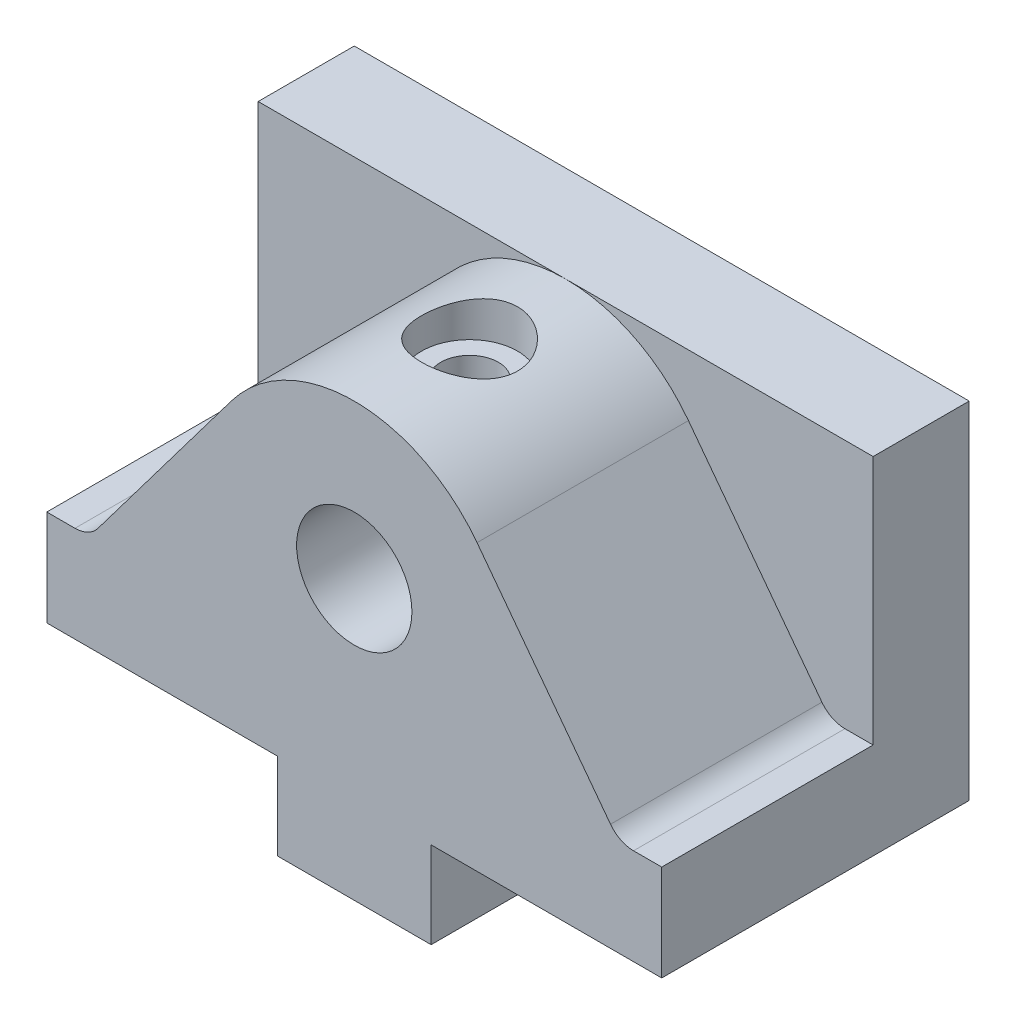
ISO-10303-21;
HEADER;
FILE_DESCRIPTION(('STEP AP214'),'2;1');
FILE_NAME('part.step','',(''),(''),'','','');
FILE_SCHEMA(('AUTOMOTIVE_DESIGN { 1 0 10303 214 1 1 1 1 }'));
ENDSEC;
DATA;
#1=APPLICATION_CONTEXT('core data for automotive mechanical design processes');
#2=APPLICATION_PROTOCOL_DEFINITION('international standard','automotive_design',2000,#1);
#3=PRODUCT_CONTEXT('',#1,'mechanical');
#4=PRODUCT('Part','Part','',(#3));
#5=PRODUCT_RELATED_PRODUCT_CATEGORY('part','',(#4));
#6=PRODUCT_DEFINITION_FORMATION('','',#4);
#7=PRODUCT_DEFINITION_CONTEXT('part definition',#1,'design');
#8=PRODUCT_DEFINITION('design','',#6,#7);
#9=PRODUCT_DEFINITION_SHAPE('','',#8);
#10=(LENGTH_UNIT() NAMED_UNIT(*) SI_UNIT(.MILLI.,.METRE.));
#11=(NAMED_UNIT(*) PLANE_ANGLE_UNIT() SI_UNIT($,.RADIAN.));
#12=(NAMED_UNIT(*) SI_UNIT($,.STERADIAN.) SOLID_ANGLE_UNIT());
#13=UNCERTAINTY_MEASURE_WITH_UNIT(LENGTH_MEASURE(1.E-05),#10,'distance_accuracy_value','');
#14=(GEOMETRIC_REPRESENTATION_CONTEXT(3) GLOBAL_UNCERTAINTY_ASSIGNED_CONTEXT((#13)) GLOBAL_UNIT_ASSIGNED_CONTEXT((#10,
#11,#12)) REPRESENTATION_CONTEXT('',''));
#15=CARTESIAN_POINT('',(0.,0.,0.));
#16=DIRECTION('',(0.,0.,1.));
#17=DIRECTION('',(1.,0.,0.));
#18=AXIS2_PLACEMENT_3D('',#15,#16,#17);
#19=CARTESIAN_POINT('',(-8.,0.,22.));
#20=DIRECTION('',(1.,0.,0.));
#21=DIRECTION('',(0.,1.,0.));
#22=AXIS2_PLACEMENT_3D('',#19,#20,#21);
#23=PLANE('',#22);
#24=DIRECTION('',(0.,0.,-1.));
#25=VECTOR('',#24,1.);
#26=CARTESIAN_POINT('',(-8.,0.,22.));
#27=LINE('',#26,#25);
#28=CARTESIAN_POINT('',(-8.,0.,22.));
#29=VERTEX_POINT('',#28);
#30=CARTESIAN_POINT('',(-8.,0.,-10.));
#31=VERTEX_POINT('',#30);
#32=EDGE_CURVE('E247',#29,#31,#27,.T.);
#33=ORIENTED_EDGE('',*,*,#32,.T.);
#34=DIRECTION('',(0.,1.,0.));
#35=VECTOR('',#34,1.);
#36=CARTESIAN_POINT('',(-8.,0.,-10.));
#37=LINE('',#36,#35);
#38=CARTESIAN_POINT('',(-8.00000000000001,-9.,-10.));
#39=VERTEX_POINT('',#38);
#40=EDGE_CURVE('E197',#39,#31,#37,.T.);
#41=ORIENTED_EDGE('',*,*,#40,.F.);
#42=DIRECTION('',(0.,0.,-1.));
#43=VECTOR('',#42,1.);
#44=CARTESIAN_POINT('',(-8.00000000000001,-9.,22.));
#45=LINE('',#44,#43);
#46=CARTESIAN_POINT('',(-8.00000000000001,-9.,22.));
#47=VERTEX_POINT('',#46);
#48=EDGE_CURVE('E270',#47,#39,#45,.T.);
#49=ORIENTED_EDGE('',*,*,#48,.F.);
#50=DIRECTION('',(0.,-1.,0.));
#51=VECTOR('',#50,1.);
#52=CARTESIAN_POINT('',(-8.,0.,22.));
#53=LINE('',#52,#51);
#54=EDGE_CURVE('E220',#29,#47,#53,.T.);
#55=ORIENTED_EDGE('',*,*,#54,.F.);
#56=EDGE_LOOP('',(#33,#41,#49,#55));
#57=FACE_BOUND('',#56,.T.);
#58=ADVANCED_FACE('F32',(#57),#23,.F.);
#59=CARTESIAN_POINT('',(-8.00000000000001,-9.,22.));
#60=DIRECTION('',(0.,1.,0.));
#61=DIRECTION('',(0.,0.,1.));
#62=AXIS2_PLACEMENT_3D('',#59,#60,#61);
#63=PLANE('',#62);
#64=CARTESIAN_POINT('',(0.,-9.,14.));
#65=DIRECTION('',(0.,-1.,0.));
#66=DIRECTION('',(0.,0.,-1.));
#67=AXIS2_PLACEMENT_3D('',#64,#65,#66);
#68=CIRCLE('',#67,2.99999999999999);
#69=CARTESIAN_POINT('',(0.,-9.,11.));
#70=VERTEX_POINT('',#69);
#71=EDGE_CURVE('E168',#70,#70,#68,.T.);
#72=ORIENTED_EDGE('',*,*,#71,.F.);
#73=EDGE_LOOP('',(#72));
#74=FACE_BOUND('',#73,.T.);
#75=CARTESIAN_POINT('',(0.,-9.,-2.));
#76=DIRECTION('',(0.,-1.,0.));
#77=DIRECTION('',(0.,0.,-1.));
#78=AXIS2_PLACEMENT_3D('',#75,#76,#77);
#79=CIRCLE('',#78,2.99999999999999);
#80=CARTESIAN_POINT('',(0.,-9.,-4.99999999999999));
#81=VERTEX_POINT('',#80);
#82=EDGE_CURVE('E167',#81,#81,#79,.T.);
#83=ORIENTED_EDGE('',*,*,#82,.F.);
#84=EDGE_LOOP('',(#83));
#85=FACE_BOUND('',#84,.T.);
#86=ORIENTED_EDGE('',*,*,#48,.T.);
#87=DIRECTION('',(-1.,0.,0.));
#88=VECTOR('',#87,1.);
#89=CARTESIAN_POINT('',(-8.00000000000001,-9.,-10.));
#90=LINE('',#89,#88);
#91=CARTESIAN_POINT('',(7.99999999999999,-9.,-10.));
#92=VERTEX_POINT('',#91);
#93=EDGE_CURVE('E194',#92,#39,#90,.T.);
#94=ORIENTED_EDGE('',*,*,#93,.F.);
#95=DIRECTION('',(0.,0.,-1.));
#96=VECTOR('',#95,1.);
#97=CARTESIAN_POINT('',(7.99999999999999,-9.,22.));
#98=LINE('',#97,#96);
#99=CARTESIAN_POINT('',(7.99999999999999,-9.,22.));
#100=VERTEX_POINT('',#99);
#101=EDGE_CURVE('E444',#100,#92,#98,.T.);
#102=ORIENTED_EDGE('',*,*,#101,.F.);
#103=DIRECTION('',(1.,0.,0.));
#104=VECTOR('',#103,1.);
#105=CARTESIAN_POINT('',(-8.00000000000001,-9.,22.));
#106=LINE('',#105,#104);
#107=EDGE_CURVE('E223',#47,#100,#106,.T.);
#108=ORIENTED_EDGE('',*,*,#107,.F.);
#109=EDGE_LOOP('',(#86,#94,#102,#108));
#110=FACE_BOUND('',#109,.T.);
#111=ADVANCED_FACE('F305',(#74,#85,#110),#63,.F.);
#112=CARTESIAN_POINT('',(7.99999999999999,-9.,22.));
#113=DIRECTION('',(-1.,0.,0.));
#114=DIRECTION('',(0.,-1.,0.));
#115=AXIS2_PLACEMENT_3D('',#112,#113,#114);
#116=PLANE('',#115);
#117=ORIENTED_EDGE('',*,*,#101,.T.);
#118=DIRECTION('',(0.,-1.,0.));
#119=VECTOR('',#118,1.);
#120=CARTESIAN_POINT('',(7.99999999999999,-9.,-10.));
#121=LINE('',#120,#119);
#122=CARTESIAN_POINT('',(8.,0.,-10.));
#123=VERTEX_POINT('',#122);
#124=EDGE_CURVE('E190',#123,#92,#121,.T.);
#125=ORIENTED_EDGE('',*,*,#124,.F.);
#126=DIRECTION('',(0.,0.,-1.));
#127=VECTOR('',#126,1.);
#128=CARTESIAN_POINT('',(8.,0.,22.));
#129=LINE('',#128,#127);
#130=CARTESIAN_POINT('',(8.,0.,22.));
#131=VERTEX_POINT('',#130);
#132=EDGE_CURVE('E424',#131,#123,#129,.T.);
#133=ORIENTED_EDGE('',*,*,#132,.F.);
#134=DIRECTION('',(0.,1.,0.));
#135=VECTOR('',#134,1.);
#136=CARTESIAN_POINT('',(7.99999999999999,-9.,22.));
#137=LINE('',#136,#135);
#138=EDGE_CURVE('E226',#100,#131,#137,.T.);
#139=ORIENTED_EDGE('',*,*,#138,.F.);
#140=EDGE_LOOP('',(#117,#125,#133,#139));
#141=FACE_BOUND('',#140,.T.);
#142=ADVANCED_FACE('F311',(#141),#116,.F.);
#143=CARTESIAN_POINT('',(8.,0.,22.));
#144=DIRECTION('',(0.,1.,0.));
#145=DIRECTION('',(0.,0.,1.));
#146=AXIS2_PLACEMENT_3D('',#143,#144,#145);
#147=PLANE('',#146);
#148=ORIENTED_EDGE('',*,*,#132,.T.);
#149=DIRECTION('',(-1.,0.,0.));
#150=VECTOR('',#149,1.);
#151=CARTESIAN_POINT('',(8.,0.,-10.));
#152=LINE('',#151,#150);
#153=CARTESIAN_POINT('',(32.,0.,-10.));
#154=VERTEX_POINT('',#153);
#155=EDGE_CURVE('E187',#154,#123,#152,.T.);
#156=ORIENTED_EDGE('',*,*,#155,.F.);
#157=DIRECTION('',(0.,0.,-1.));
#158=VECTOR('',#157,1.);
#159=CARTESIAN_POINT('',(32.,0.,22.));
#160=LINE('',#159,#158);
#161=CARTESIAN_POINT('',(32.,0.,22.));
#162=VERTEX_POINT('',#161);
#163=EDGE_CURVE('E422',#162,#154,#160,.T.);
#164=ORIENTED_EDGE('',*,*,#163,.F.);
#165=DIRECTION('',(1.,0.,0.));
#166=VECTOR('',#165,1.);
#167=CARTESIAN_POINT('',(8.,0.,22.));
#168=LINE('',#167,#166);
#169=EDGE_CURVE('E228',#131,#162,#168,.T.);
#170=ORIENTED_EDGE('',*,*,#169,.F.);
#171=EDGE_LOOP('',(#148,#156,#164,#170));
#172=FACE_BOUND('',#171,.T.);
#173=ADVANCED_FACE('F317',(#172),#147,.F.);
#174=CARTESIAN_POINT('',(32.,0.,22.));
#175=DIRECTION('',(-1.,0.,0.));
#176=DIRECTION('',(0.,0.,1.));
#177=AXIS2_PLACEMENT_3D('',#174,#175,#176);
#178=PLANE('',#177);
#179=ORIENTED_EDGE('',*,*,#163,.T.);
#180=DIRECTION('',(0.,-1.,0.));
#181=VECTOR('',#180,1.);
#182=CARTESIAN_POINT('',(32.,36.,-10.));
#183=LINE('',#182,#181);
#184=CARTESIAN_POINT('',(32.,36.,-10.));
#185=VERTEX_POINT('',#184);
#186=EDGE_CURVE('E207',#185,#154,#183,.T.);
#187=ORIENTED_EDGE('',*,*,#186,.F.);
#188=DIRECTION('',(0.,0.,1.));
#189=VECTOR('',#188,1.);
#190=CARTESIAN_POINT('',(32.,36.,-10.));
#191=LINE('',#190,#189);
#192=CARTESIAN_POINT('',(32.,36.,0.));
#193=VERTEX_POINT('',#192);
#194=EDGE_CURVE('E210',#185,#193,#191,.T.);
#195=ORIENTED_EDGE('',*,*,#194,.T.);
#196=DIRECTION('',(0.,-1.,0.));
#197=VECTOR('',#196,1.);
#198=CARTESIAN_POINT('',(32.,0.,0.));
#199=LINE('',#198,#197);
#200=CARTESIAN_POINT('',(32.,10.,0.));
#201=VERTEX_POINT('',#200);
#202=EDGE_CURVE('E191',#193,#201,#199,.T.);
#203=ORIENTED_EDGE('',*,*,#202,.T.);
#204=DIRECTION('',(0.,0.,-1.));
#205=VECTOR('',#204,1.);
#206=CARTESIAN_POINT('',(32.,10.,22.));
#207=LINE('',#206,#205);
#208=CARTESIAN_POINT('',(32.,10.,22.));
#209=VERTEX_POINT('',#208);
#210=EDGE_CURVE('E420',#209,#201,#207,.T.);
#211=ORIENTED_EDGE('',*,*,#210,.F.);
#212=DIRECTION('',(0.,1.,0.));
#213=VECTOR('',#212,1.);
#214=CARTESIAN_POINT('',(32.,0.,22.));
#215=LINE('',#214,#213);
#216=EDGE_CURVE('E230',#162,#209,#215,.T.);
#217=ORIENTED_EDGE('',*,*,#216,.F.);
#218=EDGE_LOOP('',(#179,#187,#195,#203,#211,#217));
#219=FACE_BOUND('',#218,.T.);
#220=ADVANCED_FACE('F321',(#219),#178,.F.);
#221=CARTESIAN_POINT('',(32.,10.,22.));
#222=DIRECTION('',(0.,-1.,0.));
#223=DIRECTION('',(1.,0.,0.));
#224=AXIS2_PLACEMENT_3D('',#221,#222,#223);
#225=PLANE('',#224);
#226=DIRECTION('',(-1.,0.,0.));
#227=VECTOR('',#226,1.);
#228=CARTESIAN_POINT('',(32.,10.,0.));
#229=LINE('',#228,#227);
#230=CARTESIAN_POINT('',(29.0654558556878,10.,0.));
#231=VERTEX_POINT('',#230);
#232=EDGE_CURVE('E251',#201,#231,#229,.T.);
#233=ORIENTED_EDGE('',*,*,#232,.T.);
#234=DIRECTION('',(0.,0.,-1.));
#235=VECTOR('',#234,1.);
#236=CARTESIAN_POINT('',(29.0654558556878,10.,22.));
#237=LINE('',#236,#235);
#238=CARTESIAN_POINT('',(29.0654558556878,10.,22.));
#239=VERTEX_POINT('',#238);
#240=EDGE_CURVE('E51',#231,#239,#237,.F.);
#241=ORIENTED_EDGE('',*,*,#240,.T.);
#242=DIRECTION('',(-1.,0.,0.));
#243=VECTOR('',#242,1.);
#244=CARTESIAN_POINT('',(32.,10.,22.));
#245=LINE('',#244,#243);
#246=EDGE_CURVE('E232',#209,#239,#245,.T.);
#247=ORIENTED_EDGE('',*,*,#246,.F.);
#248=ORIENTED_EDGE('',*,*,#210,.T.);
#249=EDGE_LOOP('',(#233,#241,#247,#248));
#250=FACE_BOUND('',#249,.T.);
#251=ADVANCED_FACE('F325',(#250),#225,.F.);
#252=CARTESIAN_POINT('',(27.5697110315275,9.99999999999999,22.));
#253=DIRECTION('',(-0.798635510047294,-0.601815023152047,0.));
#254=DIRECTION('',(0.601815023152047,-0.798635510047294,0.));
#255=AXIS2_PLACEMENT_3D('',#252,#253,#254);
#256=PLANE('',#255);
#257=DIRECTION('',(-0.601815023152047,0.798635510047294,0.));
#258=VECTOR('',#257,1.);
#259=CARTESIAN_POINT('',(27.5697110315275,9.99999999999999,22.));
#260=LINE('',#259,#258);
#261=CARTESIAN_POINT('',(26.6695493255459,11.1945549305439,22.));
#262=VERTEX_POINT('',#261);
#263=CARTESIAN_POINT('',(12.7781681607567,29.6290403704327,22.));
#264=VERTEX_POINT('',#263);
#265=EDGE_CURVE('E234',#262,#264,#260,.T.);
#266=ORIENTED_EDGE('',*,*,#265,.F.);
#267=DIRECTION('',(0.,0.,-1.));
#268=VECTOR('',#267,1.);
#269=CARTESIAN_POINT('',(26.6695493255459,11.1945549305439,0.));
#270=LINE('',#269,#268);
#271=CARTESIAN_POINT('',(26.6695493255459,11.1945549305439,0.));
#272=VERTEX_POINT('',#271);
#273=EDGE_CURVE('E274',#262,#272,#270,.T.);
#274=ORIENTED_EDGE('',*,*,#273,.T.);
#275=DIRECTION('',(-0.601815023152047,0.798635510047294,0.));
#276=VECTOR('',#275,1.);
#277=CARTESIAN_POINT('',(27.5697110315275,9.99999999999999,0.));
#278=LINE('',#277,#276);
#279=CARTESIAN_POINT('',(12.7781681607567,29.6290403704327,0.));
#280=VERTEX_POINT('',#279);
#281=EDGE_CURVE('E248',#272,#280,#278,.T.);
#282=ORIENTED_EDGE('',*,*,#281,.T.);
#283=DIRECTION('',(0.,0.,-1.));
#284=VECTOR('',#283,1.);
#285=CARTESIAN_POINT('',(12.7781681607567,29.6290403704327,22.));
#286=LINE('',#285,#284);
#287=EDGE_CURVE('E290',#264,#280,#286,.T.);
#288=ORIENTED_EDGE('',*,*,#287,.F.);
#289=EDGE_LOOP('',(#266,#274,#282,#288));
#290=FACE_BOUND('',#289,.T.);
#291=ADVANCED_FACE('F288',(#290),#256,.F.);
#292=CARTESIAN_POINT('',(0.,20.,22.));
#293=DIRECTION('',(0.,0.,-1.));
#294=DIRECTION('',(-1.,0.,0.));
#295=AXIS2_PLACEMENT_3D('',#292,#293,#294);
#296=CYLINDRICAL_SURFACE('',#295,16.);
#297=CARTESIAN_POINT('',(0.,36.,15.));
#298=CARTESIAN_POINT('',(-0.273756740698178,35.9999986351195,14.9999982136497));
#299=CARTESIAN_POINT('',(-0.547532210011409,35.9929077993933,14.9774430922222));
#300=CARTESIAN_POINT('',(-1.08707683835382,35.9653157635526,14.888055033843));
#301=CARTESIAN_POINT('',(-1.35284417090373,35.9448115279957,14.8212120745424));
#302=CARTESIAN_POINT('',(-1.86851417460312,35.892632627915,14.6457225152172));
#303=CARTESIAN_POINT('',(-2.11844070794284,35.860975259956,14.5371406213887));
#304=CARTESIAN_POINT('',(-2.59653920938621,35.7897587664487,14.2815307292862));
#305=CARTESIAN_POINT('',(-2.82470774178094,35.7501983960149,14.1344966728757));
#306=CARTESIAN_POINT('',(-3.25986133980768,35.6660085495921,13.8013760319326));
#307=CARTESIAN_POINT('',(-3.46608011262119,35.621268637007,13.6143164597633));
#308=CARTESIAN_POINT('',(-3.84478952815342,35.5324018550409,13.2085264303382));
#309=CARTESIAN_POINT('',(-4.01727389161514,35.4882751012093,12.9897900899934));
#310=CARTESIAN_POINT('',(-4.32777345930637,35.4044457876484,12.5202217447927));
#311=CARTESIAN_POINT('',(-4.46483136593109,35.3648795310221,12.2687300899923));
#312=CARTESIAN_POINT('',(-4.69438964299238,35.2963120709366,11.7448307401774));
#313=CARTESIAN_POINT('',(-4.78690175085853,35.2673080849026,11.4724285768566));
#314=CARTESIAN_POINT('',(-4.92193839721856,35.224304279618,10.9230876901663));
#315=CARTESIAN_POINT('',(-4.96588440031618,35.2098789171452,10.6465326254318));
#316=CARTESIAN_POINT('',(-5.00698220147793,35.1964022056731,10.0896275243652));
#317=CARTESIAN_POINT('',(-5.00414643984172,35.1973467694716,9.80927851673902));
#318=CARTESIAN_POINT('',(-4.95287298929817,35.2141275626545,9.26450215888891));
#319=CARTESIAN_POINT('',(-4.90624231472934,35.2293736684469,8.99988349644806));
#320=CARTESIAN_POINT('',(-4.7716325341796,35.272081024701,8.48243137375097));
#321=CARTESIAN_POINT('',(-4.68364903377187,35.2995435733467,8.2295991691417));
#322=CARTESIAN_POINT('',(-4.46755498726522,35.3640417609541,7.73859222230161));
#323=CARTESIAN_POINT('',(-4.33887702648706,35.4012113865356,7.5006855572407));
#324=CARTESIAN_POINT('',(-4.04544082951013,35.4808742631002,7.04924892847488));
#325=CARTESIAN_POINT('',(-3.88067322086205,35.523368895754,6.83572531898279));
#326=CARTESIAN_POINT('',(-3.51086781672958,35.6112611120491,6.42890022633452));
#327=CARTESIAN_POINT('',(-3.30433828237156,35.6567027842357,6.23696176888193));
#328=CARTESIAN_POINT('',(-2.86145763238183,35.7436628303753,5.89011242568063));
#329=CARTESIAN_POINT('',(-2.625104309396,35.7851809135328,5.73520428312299));
#330=CARTESIAN_POINT('',(-2.12665844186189,35.8600517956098,5.46588924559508));
#331=CARTESIAN_POINT('',(-1.86437962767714,35.8933384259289,5.35180745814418));
#332=CARTESIAN_POINT('',(-1.32307191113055,35.9475182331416,5.16978799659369));
#333=CARTESIAN_POINT('',(-1.04404812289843,35.9684151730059,5.10183631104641));
#334=CARTESIAN_POINT('',(-0.488740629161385,35.9948555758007,5.0163278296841));
#335=CARTESIAN_POINT('',(-0.212767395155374,36.0009609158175,4.99692582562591));
#336=CARTESIAN_POINT('',(0.338521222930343,35.9987919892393,5.00386490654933));
#337=CARTESIAN_POINT('',(0.613836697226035,35.9905198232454,5.03019930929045));
#338=CARTESIAN_POINT('',(1.14887733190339,35.9608945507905,5.12638237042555));
#339=CARTESIAN_POINT('',(1.40881991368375,35.9398717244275,5.19513307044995));
#340=CARTESIAN_POINT('',(1.91340771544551,35.8872048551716,5.37285740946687));
#341=CARTESIAN_POINT('',(2.15805104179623,35.8555595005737,5.48183601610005));
#342=CARTESIAN_POINT('',(2.63172962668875,35.783941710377,5.73989286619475));
#343=CARTESIAN_POINT('',(2.86023895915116,35.7437850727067,5.88988394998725));
#344=CARTESIAN_POINT('',(3.28946340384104,35.6597364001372,6.2246128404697));
#345=CARTESIAN_POINT('',(3.4901709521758,35.6158433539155,6.40936007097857));
#346=CARTESIAN_POINT('',(3.86634985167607,35.5270797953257,6.8170355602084));
#347=CARTESIAN_POINT('',(4.04050609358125,35.4822394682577,7.0411866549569));
#348=CARTESIAN_POINT('',(4.34885000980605,35.3984778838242,7.5165064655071));
#349=CARTESIAN_POINT('',(4.48303831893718,35.3595565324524,7.76767475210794));
#350=CARTESIAN_POINT('',(4.70680333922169,35.2924712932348,8.28938069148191));
#351=CARTESIAN_POINT('',(4.7965527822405,35.264265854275,8.55983859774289));
#352=CARTESIAN_POINT('',(4.9289157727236,35.2220468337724,9.11308997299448));
#353=CARTESIAN_POINT('',(4.97154725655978,35.2080278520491,9.39587870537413));
#354=CARTESIAN_POINT('',(5.00717624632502,35.1963317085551,9.95201635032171));
#355=CARTESIAN_POINT('',(5.00233118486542,35.1979441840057,10.2252138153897));
#356=CARTESIAN_POINT('',(4.94835272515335,35.2156036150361,10.7666983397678));
#357=CARTESIAN_POINT('',(4.89922139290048,35.2316498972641,11.0349856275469));
#358=CARTESIAN_POINT('',(4.7595091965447,35.2758725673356,11.5551761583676));
#359=CARTESIAN_POINT('',(4.66954569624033,35.3038679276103,11.8072617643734));
#360=CARTESIAN_POINT('',(4.45120909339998,35.3687881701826,12.292961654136));
#361=CARTESIAN_POINT('',(4.32282817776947,35.4057148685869,12.5265721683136));
#362=CARTESIAN_POINT('',(4.02542700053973,35.4861394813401,12.9785838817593));
#363=CARTESIAN_POINT('',(3.85501334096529,35.5298379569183,13.196032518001));
#364=CARTESIAN_POINT('',(3.48083598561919,35.6179599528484,13.599945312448));
#365=CARTESIAN_POINT('',(3.27706336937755,35.6623836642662,13.7864011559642));
#366=CARTESIAN_POINT('',(2.83394665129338,35.7486908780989,14.1291301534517));
#367=CARTESIAN_POINT('',(2.59365829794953,35.7904440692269,14.2842189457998));
#368=CARTESIAN_POINT('',(2.0891165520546,35.8650707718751,14.5515956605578));
#369=CARTESIAN_POINT('',(1.82487263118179,35.8979477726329,14.6639004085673));
#370=CARTESIAN_POINT('',(1.30299054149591,35.9488260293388,14.8343654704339));
#371=CARTESIAN_POINT('',(1.04668134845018,35.9678496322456,14.8962994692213));
#372=CARTESIAN_POINT('',(0.526919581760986,35.9934360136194,14.9791134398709));
#373=CARTESIAN_POINT('',(0.263468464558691,36.0000013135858,15.000001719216));
#374=CARTESIAN_POINT('',(0.,36.,15.));
#375=B_SPLINE_CURVE_WITH_KNOTS('',3,(#297,#298,#299,#300,#301,#302,#303,#304,#305,#306,#307,
#308,#309,#310,#311,#312,#313,#314,#315,#316,#317,#318,#319,#320,#321,#322,#323,#324,#325,#326,
#327,#328,#329,#330,#331,#332,#333,#334,#335,#336,#337,#338,#339,#340,#341,#342,#343,#344,#345,
#346,#347,#348,#349,#350,#351,#352,#353,#354,#355,#356,#357,#358,#359,#360,#361,#362,#363,#364,
#365,#366,#367,#368,#369,#370,#371,#372,#373,#374),.UNSPECIFIED.,.T.,.F.,(4,2,2,2,2,2,2,2,2,2,2,
2,2,2,2,2,2,2,2,2,2,2,2,2,2,2,2,2,2,2,2,2,2,2,2,2,2,2,4),(0.,0.820301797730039,1.64078929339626,
2.46000991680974,3.27935968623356,4.12151288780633,4.96382269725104,5.82695084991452,
6.68985145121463,7.52676600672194,8.36345801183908,9.16707669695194,9.970780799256,
10.7862257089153,11.6018826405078,12.4546698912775,13.3075202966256,14.1670184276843,
15.0262553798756,15.852302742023,16.678229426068,17.4836250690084,18.2891202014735,
19.1142529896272,19.9396098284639,20.7976711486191,21.655718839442,22.5104046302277,
23.3647649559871,24.1804881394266,24.9961732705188,25.7999165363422,26.6038233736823,
27.4391805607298,28.274761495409,29.1376267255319,30.0001522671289,30.789785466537,
31.5792588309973),.UNSPECIFIED.);
#376=CARTESIAN_POINT('',(0.,36.,15.));
#377=VERTEX_POINT('',#376);
#378=EDGE_CURVE('E11',#377,#377,#375,.T.);
#379=ORIENTED_EDGE('',*,*,#378,.T.);
#380=EDGE_LOOP('',(#379));
#381=FACE_BOUND('',#380,.T.);
#382=CARTESIAN_POINT('',(0.,20.,0.));
#383=DIRECTION('',(0.,0.,1.));
#384=DIRECTION('',(1.,0.,0.));
#385=AXIS2_PLACEMENT_3D('',#382,#383,#384);
#386=CIRCLE('',#385,16.);
#387=CARTESIAN_POINT('',(0.,36.,0.));
#388=VERTEX_POINT('',#387);
#389=EDGE_CURVE('E252',#280,#388,#386,.T.);
#390=ORIENTED_EDGE('',*,*,#389,.T.);
#391=CARTESIAN_POINT('',(-12.7781681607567,29.6290403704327,0.));
#392=VERTEX_POINT('',#391);
#393=EDGE_CURVE('E250',#388,#392,#386,.T.);
#394=ORIENTED_EDGE('',*,*,#393,.T.);
#395=DIRECTION('',(0.,0.,-1.));
#396=VECTOR('',#395,1.);
#397=CARTESIAN_POINT('',(-12.7781681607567,29.6290403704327,22.));
#398=LINE('',#397,#396);
#399=CARTESIAN_POINT('',(-12.7781681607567,29.6290403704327,22.));
#400=VERTEX_POINT('',#399);
#401=EDGE_CURVE('E426',#400,#392,#398,.T.);
#402=ORIENTED_EDGE('',*,*,#401,.F.);
#403=CARTESIAN_POINT('',(0.,20.,22.));
#404=DIRECTION('',(0.,0.,1.));
#405=DIRECTION('',(1.,0.,0.));
#406=AXIS2_PLACEMENT_3D('',#403,#404,#405);
#407=CIRCLE('',#406,16.);
#408=EDGE_CURVE('E236',#264,#400,#407,.T.);
#409=ORIENTED_EDGE('',*,*,#408,.F.);
#410=ORIENTED_EDGE('',*,*,#287,.T.);
#411=EDGE_LOOP('',(#390,#394,#402,#409,#410));
#412=FACE_BOUND('',#411,.T.);
#413=ADVANCED_FACE('F330',(#381,#412),#296,.T.);
#414=CARTESIAN_POINT('',(-12.7781681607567,29.6290403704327,22.));
#415=DIRECTION('',(0.798635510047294,-0.601815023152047,0.));
#416=DIRECTION('',(0.601815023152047,0.798635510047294,0.));
#417=AXIS2_PLACEMENT_3D('',#414,#415,#416);
#418=PLANE('',#417);
#419=DIRECTION('',(-0.601815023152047,-0.798635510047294,0.));
#420=VECTOR('',#419,1.);
#421=CARTESIAN_POINT('',(-12.7781681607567,29.6290403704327,0.));
#422=LINE('',#421,#420);
#423=CARTESIAN_POINT('',(-26.6695493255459,11.1945549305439,0.));
#424=VERTEX_POINT('',#423);
#425=EDGE_CURVE('E255',#392,#424,#422,.T.);
#426=ORIENTED_EDGE('',*,*,#425,.T.);
#427=DIRECTION('',(0.,0.,-1.));
#428=VECTOR('',#427,1.);
#429=CARTESIAN_POINT('',(-26.6695493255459,11.1945549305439,22.));
#430=LINE('',#429,#428);
#431=CARTESIAN_POINT('',(-26.6695493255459,11.1945549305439,22.));
#432=VERTEX_POINT('',#431);
#433=EDGE_CURVE('E272',#424,#432,#430,.F.);
#434=ORIENTED_EDGE('',*,*,#433,.T.);
#435=DIRECTION('',(-0.601815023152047,-0.798635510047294,0.));
#436=VECTOR('',#435,1.);
#437=CARTESIAN_POINT('',(-12.7781681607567,29.6290403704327,22.));
#438=LINE('',#437,#436);
#439=EDGE_CURVE('E238',#400,#432,#438,.T.);
#440=ORIENTED_EDGE('',*,*,#439,.F.);
#441=ORIENTED_EDGE('',*,*,#401,.T.);
#442=EDGE_LOOP('',(#426,#434,#440,#441));
#443=FACE_BOUND('',#442,.T.);
#444=ADVANCED_FACE('F334',(#443),#418,.F.);
#445=CARTESIAN_POINT('',(-27.5697110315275,9.99999999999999,22.));
#446=DIRECTION('',(0.,-1.,0.));
#447=DIRECTION('',(1.,0.,0.));
#448=AXIS2_PLACEMENT_3D('',#445,#446,#447);
#449=PLANE('',#448);
#450=DIRECTION('',(-1.,0.,0.));
#451=VECTOR('',#450,1.);
#452=CARTESIAN_POINT('',(-27.5697110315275,9.99999999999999,22.));
#453=LINE('',#452,#451);
#454=CARTESIAN_POINT('',(-29.0654558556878,10.,22.));
#455=VERTEX_POINT('',#454);
#456=CARTESIAN_POINT('',(-32.,10.,22.));
#457=VERTEX_POINT('',#456);
#458=EDGE_CURVE('E241',#455,#457,#453,.T.);
#459=ORIENTED_EDGE('',*,*,#458,.F.);
#460=DIRECTION('',(0.,0.,-1.));
#461=VECTOR('',#460,1.);
#462=CARTESIAN_POINT('',(-29.0654558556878,10.,0.));
#463=LINE('',#462,#461);
#464=CARTESIAN_POINT('',(-29.0654558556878,10.,0.));
#465=VERTEX_POINT('',#464);
#466=EDGE_CURVE('E266',#455,#465,#463,.T.);
#467=ORIENTED_EDGE('',*,*,#466,.T.);
#468=DIRECTION('',(-1.,0.,0.));
#469=VECTOR('',#468,1.);
#470=CARTESIAN_POINT('',(-27.5697110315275,9.99999999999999,0.));
#471=LINE('',#470,#469);
#472=CARTESIAN_POINT('',(-32.,10.,0.));
#473=VERTEX_POINT('',#472);
#474=EDGE_CURVE('E224',#465,#473,#471,.T.);
#475=ORIENTED_EDGE('',*,*,#474,.T.);
#476=DIRECTION('',(0.,0.,-1.));
#477=VECTOR('',#476,1.);
#478=CARTESIAN_POINT('',(-32.,10.,22.));
#479=LINE('',#478,#477);
#480=EDGE_CURVE('E433',#457,#473,#479,.T.);
#481=ORIENTED_EDGE('',*,*,#480,.F.);
#482=EDGE_LOOP('',(#459,#467,#475,#481));
#483=FACE_BOUND('',#482,.T.);
#484=ADVANCED_FACE('F338',(#483),#449,.F.);
#485=CARTESIAN_POINT('',(-32.,10.,22.));
#486=DIRECTION('',(1.,0.,0.));
#487=DIRECTION('',(0.,0.,-1.));
#488=AXIS2_PLACEMENT_3D('',#485,#486,#487);
#489=PLANE('',#488);
#490=ORIENTED_EDGE('',*,*,#480,.T.);
#491=DIRECTION('',(0.,1.,0.));
#492=VECTOR('',#491,1.);
#493=CARTESIAN_POINT('',(-32.,36.,0.));
#494=LINE('',#493,#492);
#495=CARTESIAN_POINT('',(-32.,36.,0.));
#496=VERTEX_POINT('',#495);
#497=EDGE_CURVE('E184',#473,#496,#494,.T.);
#498=ORIENTED_EDGE('',*,*,#497,.T.);
#499=DIRECTION('',(0.,0.,1.));
#500=VECTOR('',#499,1.);
#501=CARTESIAN_POINT('',(-32.,36.,-10.));
#502=LINE('',#501,#500);
#503=CARTESIAN_POINT('',(-32.,36.,-10.));
#504=VERTEX_POINT('',#503);
#505=EDGE_CURVE('E415',#504,#496,#502,.T.);
#506=ORIENTED_EDGE('',*,*,#505,.F.);
#507=DIRECTION('',(0.,1.,0.));
#508=VECTOR('',#507,1.);
#509=CARTESIAN_POINT('',(-32.,10.,-10.));
#510=LINE('',#509,#508);
#511=CARTESIAN_POINT('',(-32.,0.,-10.));
#512=VERTEX_POINT('',#511);
#513=EDGE_CURVE('E203',#512,#504,#510,.T.);
#514=ORIENTED_EDGE('',*,*,#513,.F.);
#515=DIRECTION('',(0.,0.,-1.));
#516=VECTOR('',#515,1.);
#517=CARTESIAN_POINT('',(-32.,0.,22.));
#518=LINE('',#517,#516);
#519=CARTESIAN_POINT('',(-32.,0.,22.));
#520=VERTEX_POINT('',#519);
#521=EDGE_CURVE('E435',#520,#512,#518,.T.);
#522=ORIENTED_EDGE('',*,*,#521,.F.);
#523=DIRECTION('',(0.,-1.,0.));
#524=VECTOR('',#523,1.);
#525=CARTESIAN_POINT('',(-32.,10.,22.));
#526=LINE('',#525,#524);
#527=EDGE_CURVE('E243',#457,#520,#526,.T.);
#528=ORIENTED_EDGE('',*,*,#527,.F.);
#529=EDGE_LOOP('',(#490,#498,#506,#514,#522,#528));
#530=FACE_BOUND('',#529,.T.);
#531=ADVANCED_FACE('F342',(#530),#489,.F.);
#532=CARTESIAN_POINT('',(-32.,0.,22.));
#533=DIRECTION('',(0.,1.,0.));
#534=DIRECTION('',(0.,0.,1.));
#535=AXIS2_PLACEMENT_3D('',#532,#533,#534);
#536=PLANE('',#535);
#537=ORIENTED_EDGE('',*,*,#521,.T.);
#538=DIRECTION('',(-1.,0.,0.));
#539=VECTOR('',#538,1.);
#540=CARTESIAN_POINT('',(-32.,0.,-10.));
#541=LINE('',#540,#539);
#542=EDGE_CURVE('E200',#31,#512,#541,.T.);
#543=ORIENTED_EDGE('',*,*,#542,.F.);
#544=ORIENTED_EDGE('',*,*,#32,.F.);
#545=DIRECTION('',(1.,0.,0.));
#546=VECTOR('',#545,1.);
#547=CARTESIAN_POINT('',(-32.,0.,22.));
#548=LINE('',#547,#546);
#549=EDGE_CURVE('E245',#520,#29,#548,.T.);
#550=ORIENTED_EDGE('',*,*,#549,.F.);
#551=EDGE_LOOP('',(#537,#543,#544,#550));
#552=FACE_BOUND('',#551,.T.);
#553=ADVANCED_FACE('F346',(#552),#536,.F.);
#554=CARTESIAN_POINT('',(0.,20.,22.));
#555=DIRECTION('',(0.,0.,1.));
#556=DIRECTION('',(1.,0.,0.));
#557=AXIS2_PLACEMENT_3D('',#554,#555,#556);
#558=PLANE('',#557);
#559=CARTESIAN_POINT('',(0.,20.,22.));
#560=DIRECTION('',(0.,0.,1.));
#561=DIRECTION('',(1.,0.,0.));
#562=AXIS2_PLACEMENT_3D('',#559,#560,#561);
#563=CIRCLE('',#562,6.);
#564=CARTESIAN_POINT('',(6.,20.,22.));
#565=VERTEX_POINT('',#564);
#566=EDGE_CURVE('E180',#565,#565,#563,.T.);
#567=ORIENTED_EDGE('',*,*,#566,.F.);
#568=EDGE_LOOP('',(#567));
#569=FACE_BOUND('',#568,.T.);
#570=ORIENTED_EDGE('',*,*,#54,.T.);
#571=ORIENTED_EDGE('',*,*,#107,.T.);
#572=ORIENTED_EDGE('',*,*,#138,.T.);
#573=ORIENTED_EDGE('',*,*,#169,.T.);
#574=ORIENTED_EDGE('',*,*,#216,.T.);
#575=ORIENTED_EDGE('',*,*,#246,.T.);
#576=CARTESIAN_POINT('',(29.0654558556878,13.,22.));
#577=DIRECTION('',(0.,0.,1.));
#578=DIRECTION('',(1.,0.,0.));
#579=AXIS2_PLACEMENT_3D('',#576,#577,#578);
#580=CIRCLE('',#579,3.);
#581=EDGE_CURVE('E44',#239,#262,#580,.F.);
#582=ORIENTED_EDGE('',*,*,#581,.T.);
#583=ORIENTED_EDGE('',*,*,#265,.T.);
#584=ORIENTED_EDGE('',*,*,#408,.T.);
#585=ORIENTED_EDGE('',*,*,#439,.T.);
#586=CARTESIAN_POINT('',(-29.0654558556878,13.,22.));
#587=DIRECTION('',(0.,0.,1.));
#588=DIRECTION('',(1.,0.,0.));
#589=AXIS2_PLACEMENT_3D('',#586,#587,#588);
#590=CIRCLE('',#589,3.);
#591=EDGE_CURVE('E279',#432,#455,#590,.F.);
#592=ORIENTED_EDGE('',*,*,#591,.T.);
#593=ORIENTED_EDGE('',*,*,#458,.T.);
#594=ORIENTED_EDGE('',*,*,#527,.T.);
#595=ORIENTED_EDGE('',*,*,#549,.T.);
#596=EDGE_LOOP('',(#570,#571,#572,#573,#574,#575,#582,#583,#584,#585,#592,#593,#594,#595));
#597=FACE_BOUND('',#596,.T.);
#598=ADVANCED_FACE('F283',(#569,#597),#558,.T.);
#599=CARTESIAN_POINT('',(32.,0.,0.));
#600=DIRECTION('',(0.,0.,1.));
#601=DIRECTION('',(1.,0.,0.));
#602=AXIS2_PLACEMENT_3D('',#599,#600,#601);
#603=PLANE('',#602);
#604=ORIENTED_EDGE('',*,*,#474,.F.);
#605=CARTESIAN_POINT('',(-29.0654558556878,13.,0.));
#606=DIRECTION('',(0.,0.,1.));
#607=DIRECTION('',(1.,0.,0.));
#608=AXIS2_PLACEMENT_3D('',#605,#606,#607);
#609=CIRCLE('',#608,3.);
#610=EDGE_CURVE('E269',#465,#424,#609,.T.);
#611=ORIENTED_EDGE('',*,*,#610,.T.);
#612=ORIENTED_EDGE('',*,*,#425,.F.);
#613=ORIENTED_EDGE('',*,*,#393,.F.);
#614=DIRECTION('',(1.,0.,0.));
#615=VECTOR('',#614,1.);
#616=CARTESIAN_POINT('',(32.,36.,0.));
#617=LINE('',#616,#615);
#618=EDGE_CURVE('E213',#496,#388,#617,.T.);
#619=ORIENTED_EDGE('',*,*,#618,.F.);
#620=ORIENTED_EDGE('',*,*,#497,.F.);
#621=EDGE_LOOP('',(#604,#611,#612,#613,#619,#620));
#622=FACE_BOUND('',#621,.T.);
#623=ADVANCED_FACE('F353',(#622),#603,.T.);
#624=ORIENTED_EDGE('',*,*,#281,.F.);
#625=CARTESIAN_POINT('',(29.0654558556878,13.,0.));
#626=DIRECTION('',(0.,0.,1.));
#627=DIRECTION('',(1.,0.,0.));
#628=AXIS2_PLACEMENT_3D('',#625,#626,#627);
#629=CIRCLE('',#628,3.);
#630=EDGE_CURVE('E59',#272,#231,#629,.T.);
#631=ORIENTED_EDGE('',*,*,#630,.T.);
#632=ORIENTED_EDGE('',*,*,#232,.F.);
#633=ORIENTED_EDGE('',*,*,#202,.F.);
#634=EDGE_CURVE('E218',#388,#193,#617,.T.);
#635=ORIENTED_EDGE('',*,*,#634,.F.);
#636=ORIENTED_EDGE('',*,*,#389,.F.);
#637=EDGE_LOOP('',(#624,#631,#632,#633,#635,#636));
#638=FACE_BOUND('',#637,.T.);
#639=ADVANCED_FACE('F358',(#638),#603,.T.);
#640=CARTESIAN_POINT('',(32.,36.,-10.));
#641=DIRECTION('',(0.,-1.,0.));
#642=DIRECTION('',(0.,0.,-1.));
#643=AXIS2_PLACEMENT_3D('',#640,#641,#642);
#644=PLANE('',#643);
#645=ORIENTED_EDGE('',*,*,#618,.T.);
#646=ORIENTED_EDGE('',*,*,#634,.T.);
#647=ORIENTED_EDGE('',*,*,#194,.F.);
#648=DIRECTION('',(1.,0.,0.));
#649=VECTOR('',#648,1.);
#650=CARTESIAN_POINT('',(32.,36.,-10.));
#651=LINE('',#650,#649);
#652=EDGE_CURVE('E205',#504,#185,#651,.T.);
#653=ORIENTED_EDGE('',*,*,#652,.F.);
#654=ORIENTED_EDGE('',*,*,#505,.T.);
#655=EDGE_LOOP('',(#645,#646,#647,#653,#654));
#656=FACE_BOUND('',#655,.T.);
#657=ADVANCED_FACE('F355',(#656),#644,.F.);
#658=CARTESIAN_POINT('',(32.,0.,-10.));
#659=DIRECTION('',(0.,0.,1.));
#660=DIRECTION('',(1.,0.,0.));
#661=AXIS2_PLACEMENT_3D('',#658,#659,#660);
#662=PLANE('',#661);
#663=ORIENTED_EDGE('',*,*,#155,.T.);
#664=ORIENTED_EDGE('',*,*,#124,.T.);
#665=ORIENTED_EDGE('',*,*,#93,.T.);
#666=ORIENTED_EDGE('',*,*,#40,.T.);
#667=ORIENTED_EDGE('',*,*,#542,.T.);
#668=ORIENTED_EDGE('',*,*,#513,.T.);
#669=ORIENTED_EDGE('',*,*,#652,.T.);
#670=ORIENTED_EDGE('',*,*,#186,.T.);
#671=EDGE_LOOP('',(#663,#664,#665,#666,#667,#668,#669,#670));
#672=FACE_BOUND('',#671,.T.);
#673=ADVANCED_FACE('F302',(#672),#662,.F.);
#674=CARTESIAN_POINT('',(-29.0654558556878,13.,22.));
#675=DIRECTION('',(0.,0.,1.));
#676=DIRECTION('',(1.,0.,0.));
#677=AXIS2_PLACEMENT_3D('',#674,#675,#676);
#678=CYLINDRICAL_SURFACE('',#677,3.);
#679=ORIENTED_EDGE('',*,*,#591,.F.);
#680=ORIENTED_EDGE('',*,*,#433,.F.);
#681=ORIENTED_EDGE('',*,*,#610,.F.);
#682=ORIENTED_EDGE('',*,*,#466,.F.);
#683=EDGE_LOOP('',(#679,#680,#681,#682));
#684=FACE_BOUND('',#683,.T.);
#685=ADVANCED_FACE('F294',(#684),#678,.F.);
#686=CARTESIAN_POINT('',(29.0654558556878,13.,22.));
#687=DIRECTION('',(0.,0.,1.));
#688=DIRECTION('',(1.,0.,0.));
#689=AXIS2_PLACEMENT_3D('',#686,#687,#688);
#690=CYLINDRICAL_SURFACE('',#689,3.);
#691=ORIENTED_EDGE('',*,*,#581,.F.);
#692=ORIENTED_EDGE('',*,*,#240,.F.);
#693=ORIENTED_EDGE('',*,*,#630,.F.);
#694=ORIENTED_EDGE('',*,*,#273,.F.);
#695=EDGE_LOOP('',(#691,#692,#693,#694));
#696=FACE_BOUND('',#695,.T.);
#697=ADVANCED_FACE('F34',(#696),#690,.F.);
#698=CARTESIAN_POINT('',(0.,20.,-2.));
#699=DIRECTION('',(0.,0.,1.));
#700=DIRECTION('',(1.,0.,0.));
#701=AXIS2_PLACEMENT_3D('',#698,#699,#700);
#702=CYLINDRICAL_SURFACE('',#701,6.);
#703=CARTESIAN_POINT('',(0.,26.,13.));
#704=CARTESIAN_POINT('',(0.0788941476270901,25.9999993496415,12.9999991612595));
#705=CARTESIAN_POINT('',(0.15779662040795,25.9984386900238,12.9968820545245));
#706=CARTESIAN_POINT('',(0.315001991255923,25.9922435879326,12.98446072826));
#707=CARTESIAN_POINT('',(0.393304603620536,25.987607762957,12.9751537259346));
#708=CARTESIAN_POINT('',(0.626628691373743,25.9692197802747,12.9380421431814));
#709=CARTESIAN_POINT('',(0.779952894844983,25.950987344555,12.9010471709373));
#710=CARTESIAN_POINT('',(1.07683586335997,25.9044896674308,12.8044182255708));
#711=CARTESIAN_POINT('',(1.22043005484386,25.8762634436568,12.7448722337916));
#712=CARTESIAN_POINT('',(1.49540820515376,25.8123730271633,12.6052887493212));
#713=CARTESIAN_POINT('',(1.62679312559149,25.7767094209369,12.5252528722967));
#714=CARTESIAN_POINT('',(1.88252701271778,25.6986875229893,12.3414460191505));
#715=CARTESIAN_POINT('',(2.0059694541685,25.6560547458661,12.2365320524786));
#716=CARTESIAN_POINT('',(2.23433451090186,25.5698003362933,12.0084440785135));
#717=CARTESIAN_POINT('',(2.33924301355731,25.5261779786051,11.8852562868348));
#718=CARTESIAN_POINT('',(2.53576864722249,25.4389634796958,11.6125156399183));
#719=CARTESIAN_POINT('',(2.62572411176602,25.3956360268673,11.4616590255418));
#720=CARTESIAN_POINT('',(2.74034031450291,25.3378244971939,11.2240491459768));
#721=CARTESIAN_POINT('',(2.77516786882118,25.3197457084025,11.1429290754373));
#722=CARTESIAN_POINT('',(2.83769299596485,25.2866576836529,10.9773994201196));
#723=CARTESIAN_POINT('',(2.86539478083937,25.2716466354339,10.8929918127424));
#724=CARTESIAN_POINT('',(2.91188280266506,25.2461034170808,10.7266042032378));
#725=CARTESIAN_POINT('',(2.93110042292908,25.235358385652,10.6447772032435));
#726=CARTESIAN_POINT('',(2.96263559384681,25.2175778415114,10.4794450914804));
#727=CARTESIAN_POINT('',(2.9749568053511,25.2105403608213,10.3959408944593));
#728=CARTESIAN_POINT('',(2.99251382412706,25.2004775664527,10.2279936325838));
#729=CARTESIAN_POINT('',(2.99775389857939,25.1974498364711,10.1435511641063));
#730=CARTESIAN_POINT('',(3.00108452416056,25.1955255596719,9.97450634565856));
#731=CARTESIAN_POINT('',(2.99917575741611,25.1966286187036,9.88990401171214));
#732=CARTESIAN_POINT('',(2.98404973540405,25.2053466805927,9.65724610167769));
#733=CARTESIAN_POINT('',(2.96335042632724,25.2172679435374,9.50975584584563));
#734=CARTESIAN_POINT('',(2.90082280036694,25.2522818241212,9.22080632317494));
#735=CARTESIAN_POINT('',(2.85898775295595,25.2753780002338,9.07934899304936));
#736=CARTESIAN_POINT('',(2.75462843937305,25.3306256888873,8.80232034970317));
#737=CARTESIAN_POINT('',(2.69164495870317,25.36297559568,8.66696288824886));
#738=CARTESIAN_POINT('',(2.547125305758,25.4331017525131,8.40809503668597));
#739=CARTESIAN_POINT('',(2.46558080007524,25.4708804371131,8.28459000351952));
#740=CARTESIAN_POINT('',(2.27419808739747,25.5533948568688,8.03643690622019));
#741=CARTESIAN_POINT('',(2.16208335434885,25.5984053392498,7.9136295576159));
#742=CARTESIAN_POINT('',(1.91866675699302,25.6864286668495,7.68779356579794));
#743=CARTESIAN_POINT('',(1.78735577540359,25.7294405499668,7.58477437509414));
#744=CARTESIAN_POINT('',(1.50154951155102,25.8110596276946,7.39694306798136));
#745=CARTESIAN_POINT('',(1.3462607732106,25.8493695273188,7.31319859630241));
#746=CARTESIAN_POINT('',(1.02139864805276,25.9147364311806,7.17370889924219));
#747=CARTESIAN_POINT('',(0.851836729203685,25.9418023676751,7.11794144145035));
#748=CARTESIAN_POINT('',(0.518299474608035,25.9797300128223,7.04057379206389));
#749=CARTESIAN_POINT('',(0.355024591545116,25.9917481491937,7.01652629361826));
#750=CARTESIAN_POINT('',(0.0263387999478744,26.0021904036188,6.99560580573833));
#751=CARTESIAN_POINT('',(-0.139071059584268,26.0006209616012,6.99871994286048));
#752=CARTESIAN_POINT('',(-0.453698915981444,25.9847357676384,7.0306200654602));
#753=CARTESIAN_POINT('',(-0.603178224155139,25.9714173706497,7.05739759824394));
#754=CARTESIAN_POINT('',(-0.895220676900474,25.9346651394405,7.13271421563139));
#755=CARTESIAN_POINT('',(-1.03778305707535,25.911230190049,7.18125569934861));
#756=CARTESIAN_POINT('',(-1.31666582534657,25.8555275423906,7.2999953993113));
#757=CARTESIAN_POINT('',(-1.45269119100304,25.8230264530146,7.37077315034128));
#758=CARTESIAN_POINT('',(-1.71138408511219,25.7523192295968,7.53132260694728));
#759=CARTESIAN_POINT('',(-1.83404588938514,25.7141106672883,7.62110240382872));
#760=CARTESIAN_POINT('',(-2.07530306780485,25.6312466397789,7.82728127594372));
#761=CARTESIAN_POINT('',(-2.19231623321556,25.5863265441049,7.94542860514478));
#762=CARTESIAN_POINT('',(-2.40556896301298,25.497871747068,8.1997754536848));
#763=CARTESIAN_POINT('',(-2.50179415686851,25.4543380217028,8.33598735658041));
#764=CARTESIAN_POINT('',(-2.67512374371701,25.3715357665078,8.63093096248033));
#765=CARTESIAN_POINT('',(-2.75107648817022,25.3325758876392,8.79043379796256));
#766=CARTESIAN_POINT('',(-2.87424847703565,25.2672221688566,9.12253020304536));
#767=CARTESIAN_POINT('',(-2.92150474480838,25.2408121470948,9.29510658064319));
#768=CARTESIAN_POINT('',(-2.98158506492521,25.2068450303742,9.63073066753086));
#769=CARTESIAN_POINT('',(-2.99727899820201,25.1977215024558,9.79310275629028));
#770=CARTESIAN_POINT('',(-3.00206745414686,25.1949606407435,10.1183412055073));
#771=CARTESIAN_POINT('',(-2.99117350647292,25.2013165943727,10.2812073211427));
#772=CARTESIAN_POINT('',(-2.94577840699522,25.227135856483,10.5864504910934));
#773=CARTESIAN_POINT('',(-2.91362505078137,25.2452928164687,10.7293013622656));
#774=CARTESIAN_POINT('',(-2.8295259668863,25.2911305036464,11.0074244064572));
#775=CARTESIAN_POINT('',(-2.77757387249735,25.3188142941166,11.142694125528));
#776=CARTESIAN_POINT('',(-2.65144766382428,25.3828558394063,11.4118743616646));
#777=CARTESIAN_POINT('',(-2.57601505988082,25.4196713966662,11.5450829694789));
#778=CARTESIAN_POINT('',(-2.4064512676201,25.4970602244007,11.7978243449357));
#779=CARTESIAN_POINT('',(-2.3123103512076,25.5376354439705,11.9173499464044));
#780=CARTESIAN_POINT('',(-2.094616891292,25.6238685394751,12.1544228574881));
#781=CARTESIAN_POINT('',(-1.96888052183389,25.6695449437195,12.2699651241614));
#782=CARTESIAN_POINT('',(-1.69843715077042,25.7563371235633,12.478801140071));
#783=CARTESIAN_POINT('',(-1.55371998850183,25.7974504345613,12.5720828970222));
#784=CARTESIAN_POINT('',(-1.32452333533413,25.8525140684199,12.6931781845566));
#785=CARTESIAN_POINT('',(-1.24575314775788,25.8698252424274,12.7305202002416));
#786=CARTESIAN_POINT('',(-1.0847972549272,25.9016884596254,12.7983616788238));
#787=CARTESIAN_POINT('',(-1.00261324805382,25.9162418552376,12.8288644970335));
#788=CARTESIAN_POINT('',(-0.83561699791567,25.9421269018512,12.8826072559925));
#789=CARTESIAN_POINT('',(-0.750810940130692,25.9534655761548,12.905863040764));
#790=CARTESIAN_POINT('',(-0.579142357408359,25.9726077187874,12.9448825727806));
#791=CARTESIAN_POINT('',(-0.492281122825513,25.9804133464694,12.9606508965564));
#792=CARTESIAN_POINT('',(-0.337824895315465,25.9908582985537,12.9816846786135));
#793=CARTESIAN_POINT('',(-0.270495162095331,25.9942803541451,12.988546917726));
#794=CARTESIAN_POINT('',(-0.135445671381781,25.9988515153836,12.9977050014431));
#795=CARTESIAN_POINT('',(-0.0677259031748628,26.0000005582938,13.0000007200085));
#796=CARTESIAN_POINT('',(0.,26.,13.));
#797=B_SPLINE_CURVE_WITH_KNOTS('',3,(#703,#704,#705,#706,#707,#708,#709,#710,#711,#712,#713,
#714,#715,#716,#717,#718,#719,#720,#721,#722,#723,#724,#725,#726,#727,#728,#729,#730,#731,#732,
#733,#734,#735,#736,#737,#738,#739,#740,#741,#742,#743,#744,#745,#746,#747,#748,#749,#750,#751,
#752,#753,#754,#755,#756,#757,#758,#759,#760,#761,#762,#763,#764,#765,#766,#767,#768,#769,#770,
#771,#772,#773,#774,#775,#776,#777,#778,#779,#780,#781,#782,#783,#784,#785,#786,#787,#788,#789,
#790,#791,#792,#793,#794,#795,#796),.UNSPECIFIED.,.T.,.F.,(4,2,2,2,2,2,2,2,2,2,2,2,2,2,2,2,2,2,
2,2,2,2,2,2,2,2,2,2,2,2,2,2,2,2,2,2,2,2,2,2,2,2,2,2,2,2,4),(0.,0.236611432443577,
0.473329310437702,0.947100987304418,1.41904300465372,1.89094781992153,2.39140181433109,
2.89223525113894,3.43190833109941,3.70192714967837,3.97178599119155,4.2256372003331,
4.47935352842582,4.73291689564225,4.98645606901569,5.43238672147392,5.87845946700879,
6.33492255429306,6.79159098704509,7.30616358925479,7.82098138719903,8.35970601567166,
8.89800185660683,9.39171406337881,9.88519228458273,10.3404225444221,10.7957029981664,
11.2640010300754,11.7324988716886,12.2470036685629,12.7618630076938,13.3016558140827,
13.8407507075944,14.3280945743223,14.8152271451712,15.2559532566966,15.6968212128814,
16.1673090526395,16.6380421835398,17.1659726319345,17.694186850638,17.9605054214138,
18.2266930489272,18.4922945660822,18.7577335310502,18.9608446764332,19.1639614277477),.UNSPECIFIED.);
#798=CARTESIAN_POINT('',(0.,26.,13.));
#799=VERTEX_POINT('',#798);
#800=EDGE_CURVE('E174',#799,#799,#797,.T.);
#801=ORIENTED_EDGE('',*,*,#800,.T.);
#802=EDGE_LOOP('',(#801));
#803=FACE_BOUND('',#802,.T.);
#804=CARTESIAN_POINT('',(0.,20.,-2.));
#805=DIRECTION('',(0.,0.,1.));
#806=DIRECTION('',(1.,0.,0.));
#807=AXIS2_PLACEMENT_3D('',#804,#805,#806);
#808=CIRCLE('',#807,6.);
#809=CARTESIAN_POINT('',(6.,20.,-2.));
#810=VERTEX_POINT('',#809);
#811=EDGE_CURVE('E181',#810,#810,#808,.T.);
#812=ORIENTED_EDGE('',*,*,#811,.F.);
#813=EDGE_LOOP('',(#812));
#814=FACE_BOUND('',#813,.T.);
#815=ORIENTED_EDGE('',*,*,#566,.T.);
#816=EDGE_LOOP('',(#815));
#817=FACE_BOUND('',#816,.T.);
#818=ADVANCED_FACE('F293',(#803,#814,#817),#702,.F.);
#819=CARTESIAN_POINT('',(0.,20.,-2.));
#820=DIRECTION('',(0.,0.,1.));
#821=DIRECTION('',(1.,0.,0.));
#822=AXIS2_PLACEMENT_3D('',#819,#820,#821);
#823=PLANE('',#822);
#824=ORIENTED_EDGE('',*,*,#811,.T.);
#825=EDGE_LOOP('',(#824));
#826=FACE_BOUND('',#825,.T.);
#827=ADVANCED_FACE('F299',(#826),#823,.T.);
#828=CARTESIAN_POINT('',(0.,7.,-2.));
#829=DIRECTION('',(0.,-1.,0.));
#830=DIRECTION('',(0.,0.,-1.));
#831=AXIS2_PLACEMENT_3D('',#828,#829,#830);
#832=CONICAL_SURFACE('',#831,3.,1.02974425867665);
#833=CARTESIAN_POINT('',(0.,8.80258185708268,-2.));
#834=VERTEX_POINT('',#833);
#835=VERTEX_LOOP('',#834);
#836=FACE_BOUND('',#835,.T.);
#837=CARTESIAN_POINT('',(0.,7.,-2.));
#838=DIRECTION('',(0.,-1.,0.));
#839=DIRECTION('',(0.,0.,-1.));
#840=AXIS2_PLACEMENT_3D('',#837,#838,#839);
#841=CIRCLE('',#840,3.);
#842=CARTESIAN_POINT('',(0.,7.,-5.));
#843=VERTEX_POINT('',#842);
#844=EDGE_CURVE('E171',#843,#843,#841,.T.);
#845=ORIENTED_EDGE('',*,*,#844,.T.);
#846=EDGE_LOOP('',(#845));
#847=FACE_BOUND('',#846,.T.);
#848=ADVANCED_FACE('F368',(#836,#847),#832,.F.);
#849=CARTESIAN_POINT('',(0.,-9.,-2.));
#850=DIRECTION('',(0.,-1.,0.));
#851=DIRECTION('',(0.,0.,-1.));
#852=AXIS2_PLACEMENT_3D('',#849,#850,#851);
#853=CYLINDRICAL_SURFACE('',#852,2.99999999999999);
#854=ORIENTED_EDGE('',*,*,#844,.F.);
#855=EDGE_LOOP('',(#854));
#856=FACE_BOUND('',#855,.T.);
#857=ORIENTED_EDGE('',*,*,#82,.T.);
#858=EDGE_LOOP('',(#857));
#859=FACE_BOUND('',#858,.T.);
#860=ADVANCED_FACE('F161',(#856,#859),#853,.F.);
#861=CARTESIAN_POINT('',(0.,7.,14.));
#862=DIRECTION('',(0.,-1.,0.));
#863=DIRECTION('',(0.,0.,-1.));
#864=AXIS2_PLACEMENT_3D('',#861,#862,#863);
#865=CONICAL_SURFACE('',#864,3.,1.02974425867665);
#866=CARTESIAN_POINT('',(0.,8.80258185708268,14.));
#867=VERTEX_POINT('',#866);
#868=VERTEX_LOOP('',#867);
#869=FACE_BOUND('',#868,.T.);
#870=CARTESIAN_POINT('',(0.,7.,14.));
#871=DIRECTION('',(0.,-1.,0.));
#872=DIRECTION('',(0.,0.,-1.));
#873=AXIS2_PLACEMENT_3D('',#870,#871,#872);
#874=CIRCLE('',#873,3.);
#875=CARTESIAN_POINT('',(0.,7.,11.));
#876=VERTEX_POINT('',#875);
#877=EDGE_CURVE('E165',#876,#876,#874,.T.);
#878=ORIENTED_EDGE('',*,*,#877,.T.);
#879=EDGE_LOOP('',(#878));
#880=FACE_BOUND('',#879,.T.);
#881=ADVANCED_FACE('F157',(#869,#880),#865,.F.);
#882=CARTESIAN_POINT('',(0.,-9.,14.));
#883=DIRECTION('',(0.,-1.,0.));
#884=DIRECTION('',(0.,0.,-1.));
#885=AXIS2_PLACEMENT_3D('',#882,#883,#884);
#886=CYLINDRICAL_SURFACE('',#885,2.99999999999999);
#887=ORIENTED_EDGE('',*,*,#877,.F.);
#888=EDGE_LOOP('',(#887));
#889=FACE_BOUND('',#888,.T.);
#890=ORIENTED_EDGE('',*,*,#71,.T.);
#891=EDGE_LOOP('',(#890));
#892=FACE_BOUND('',#891,.T.);
#893=ADVANCED_FACE('F160',(#889,#892),#886,.F.);
#894=CARTESIAN_POINT('',(0.,36.,10.));
#895=DIRECTION('',(0.,1.,0.));
#896=DIRECTION('',(0.,0.,1.));
#897=AXIS2_PLACEMENT_3D('',#894,#895,#896);
#898=CYLINDRICAL_SURFACE('',#897,5.);
#899=CARTESIAN_POINT('',(0.,32.,10.));
#900=DIRECTION('',(0.,1.,0.));
#901=DIRECTION('',(0.,0.,1.));
#902=AXIS2_PLACEMENT_3D('',#899,#900,#901);
#903=CIRCLE('',#902,5.);
#904=CARTESIAN_POINT('',(0.,32.,15.));
#905=VERTEX_POINT('',#904);
#906=EDGE_CURVE('E391',#905,#905,#903,.T.);
#907=ORIENTED_EDGE('',*,*,#906,.F.);
#908=EDGE_LOOP('',(#907));
#909=FACE_BOUND('',#908,.T.);
#910=ORIENTED_EDGE('',*,*,#378,.F.);
#911=EDGE_LOOP('',(#910));
#912=FACE_BOUND('',#911,.T.);
#913=ADVANCED_FACE('F378',(#909,#912),#898,.F.);
#914=CARTESIAN_POINT('',(0.,36.,10.));
#915=DIRECTION('',(0.,1.,0.));
#916=DIRECTION('',(0.,0.,1.));
#917=AXIS2_PLACEMENT_3D('',#914,#915,#916);
#918=CYLINDRICAL_SURFACE('',#917,3.00000000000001);
#919=ORIENTED_EDGE('',*,*,#800,.F.);
#920=EDGE_LOOP('',(#919));
#921=FACE_BOUND('',#920,.T.);
#922=CARTESIAN_POINT('',(0.,32.,10.));
#923=DIRECTION('',(0.,1.,0.));
#924=DIRECTION('',(0.,0.,1.));
#925=AXIS2_PLACEMENT_3D('',#922,#923,#924);
#926=CIRCLE('',#925,3.00000000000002);
#927=CARTESIAN_POINT('',(0.,32.,13.));
#928=VERTEX_POINT('',#927);
#929=EDGE_CURVE('E388',#928,#928,#926,.T.);
#930=ORIENTED_EDGE('',*,*,#929,.T.);
#931=EDGE_LOOP('',(#930));
#932=FACE_BOUND('',#931,.T.);
#933=ADVANCED_FACE('F381',(#921,#932),#918,.F.);
#934=CARTESIAN_POINT('',(3.00000000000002,32.,10.));
#935=DIRECTION('',(0.,-1.,0.));
#936=DIRECTION('',(0.,0.,-1.));
#937=AXIS2_PLACEMENT_3D('',#934,#935,#936);
#938=PLANE('',#937);
#939=ORIENTED_EDGE('',*,*,#929,.F.);
#940=EDGE_LOOP('',(#939));
#941=FACE_BOUND('',#940,.T.);
#942=ORIENTED_EDGE('',*,*,#906,.T.);
#943=EDGE_LOOP('',(#942));
#944=FACE_BOUND('',#943,.T.);
#945=ADVANCED_FACE('F395',(#941,#944),#938,.F.);
#946=CLOSED_SHELL('',(#58,#111,#142,#173,#220,#251,#291,#413,#444,#484,#531,#553,#598,#623,#639,
#657,#673,#685,#697,#818,#827,#848,#860,#881,#893,#913,#933,#945));
#947=MANIFOLD_SOLID_BREP('B2',#946);
#948=ADVANCED_BREP_SHAPE_REPRESENTATION('',(#18,#947),#14);
#949=SHAPE_DEFINITION_REPRESENTATION(#9,#948);
ENDSEC;
END-ISO-10303-21;
